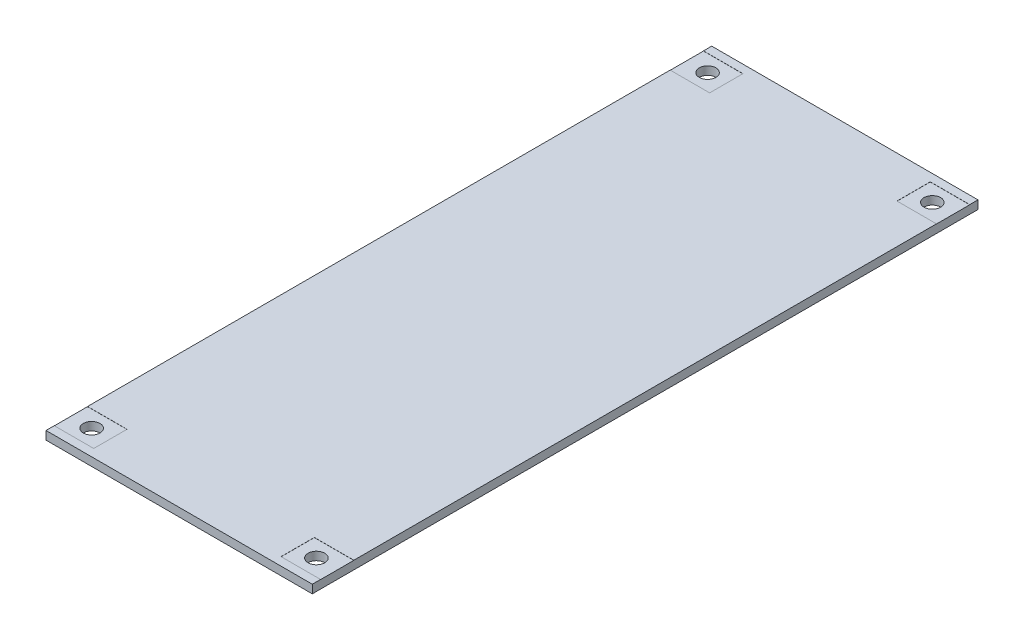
from build123d import *

# Parameters (mm, degrees)
SKETCH1_W           = 50.8
SKETCH1_H           = 127
SKETCH1_R           = 1.5875
BOSS_EXTRUDE1_DEPTH = 1.6002
CUT_EXTRUDE1_DEPTH  = 0.0254


with BuildPart() as part:
    # Sketch1 → Boss-Extrude1 (new body)
    with BuildSketch(Plane(origin=(0, 0, 0), x_dir=(1, 0, 0), z_dir=(0, 1, 0))):
        with Locations((25.4, 63.5)):
            Rectangle(SKETCH1_W, SKETCH1_H)
        with Locations(Location((3.9624, 4.7498, 0), (0, 0, 270))):
            Circle(SKETCH1_R, mode=Mode.SUBTRACT)
        with Locations(Location((46.84, 4.7498, 0), (0, 0, 270))):
            Circle(SKETCH1_R, mode=Mode.SUBTRACT)
        with Locations(Location((3.9624, 122.2502, 0), (0, 0, 270))):
            Circle(SKETCH1_R, mode=Mode.SUBTRACT)
        with Locations(Location((46.8376, 122.2502, 0), (0, 0, 270))):
            Circle(SKETCH1_R, mode=Mode.SUBTRACT)
    extrude(amount=BOSS_EXTRUDE1_DEPTH)

    # Sketch2 → Cut-Extrude1 (cut)
    with BuildSketch(Plane(origin=(0, 1.6002, 0), x_dir=(1, 0, 0), z_dir=(0, 1, 0))):
        Polygon((0.3937, 1.5748), (7.5311, 1.5748), (7.5311, 7.9248), (0.3937, 7.9248), (0, 7.9248), (0, 1.5748), align=None)
        Polygon((0.3937, 119.0752), (7.5311, 119.0752), (7.5311, 125.4252), (0.3937, 125.4252), (0, 125.4252), (0, 119.0752), align=None)
        Polygon((50.4063, 125.4252), (43.2689, 125.4252), (43.2689, 119.0752), (50.4063, 119.0752), (50.8, 119.0752), (50.8, 125.4252), align=None)
        Polygon((50.4063, 7.9248), (43.2689, 7.9248), (43.2689, 1.5748), (50.4063, 1.5748), (50.8, 1.5748), (50.8, 7.9248), align=None)
    extrude(amount=-CUT_EXTRUDE1_DEPTH, mode=Mode.SUBTRACT)


solid = part.part
